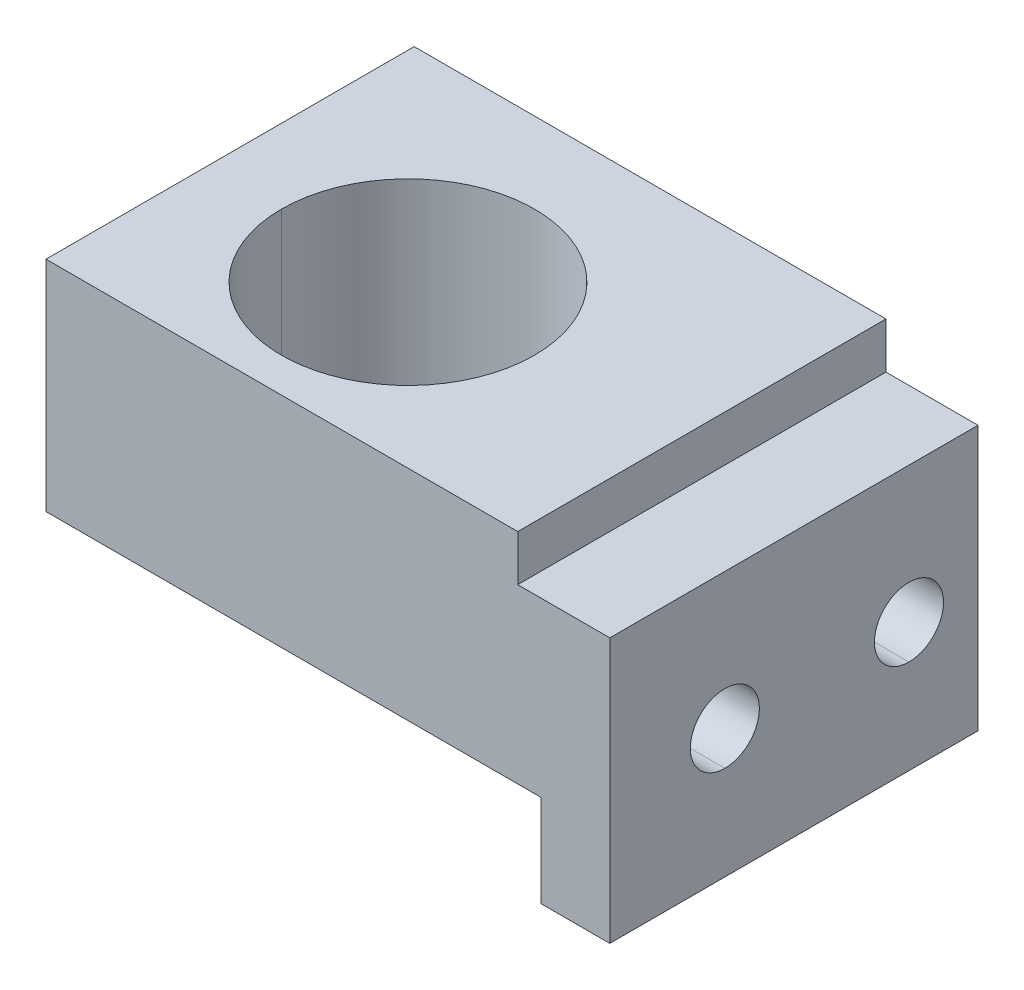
ISO-10303-21;
HEADER;
FILE_DESCRIPTION(('STEP AP214'),'2;1');
FILE_NAME('part.step','',(''),(''),'','','');
FILE_SCHEMA(('AUTOMOTIVE_DESIGN { 1 0 10303 214 1 1 1 1 }'));
ENDSEC;
DATA;
#1=APPLICATION_CONTEXT('core data for automotive mechanical design processes');
#2=APPLICATION_PROTOCOL_DEFINITION('international standard','automotive_design',2000,#1);
#3=PRODUCT_CONTEXT('',#1,'mechanical');
#4=PRODUCT('Part','Part','',(#3));
#5=PRODUCT_RELATED_PRODUCT_CATEGORY('part','',(#4));
#6=PRODUCT_DEFINITION_FORMATION('','',#4);
#7=PRODUCT_DEFINITION_CONTEXT('part definition',#1,'design');
#8=PRODUCT_DEFINITION('design','',#6,#7);
#9=PRODUCT_DEFINITION_SHAPE('','',#8);
#10=(LENGTH_UNIT() NAMED_UNIT(*) SI_UNIT(.MILLI.,.METRE.));
#11=(NAMED_UNIT(*) PLANE_ANGLE_UNIT() SI_UNIT($,.RADIAN.));
#12=(NAMED_UNIT(*) SI_UNIT($,.STERADIAN.) SOLID_ANGLE_UNIT());
#13=UNCERTAINTY_MEASURE_WITH_UNIT(LENGTH_MEASURE(1.E-05),#10,'distance_accuracy_value','');
#14=(GEOMETRIC_REPRESENTATION_CONTEXT(3) GLOBAL_UNCERTAINTY_ASSIGNED_CONTEXT((#13)) GLOBAL_UNIT_ASSIGNED_CONTEXT((#10,
#11,#12)) REPRESENTATION_CONTEXT('',''));
#15=CARTESIAN_POINT('',(0.,0.,0.));
#16=DIRECTION('',(0.,0.,1.));
#17=DIRECTION('',(1.,0.,0.));
#18=AXIS2_PLACEMENT_3D('',#15,#16,#17);
#19=CARTESIAN_POINT('',(29.36875,-3.68299999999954,-15.875));
#20=DIRECTION('',(1.,0.,0.));
#21=DIRECTION('',(0.,0.,-1.));
#22=AXIS2_PLACEMENT_3D('',#19,#20,#21);
#23=PLANE('',#22);
#24=CARTESIAN_POINT('',(29.36875,-3.68299999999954,-15.875));
#25=DIRECTION('',(1.,0.,0.));
#26=DIRECTION('',(0.,0.,-1.));
#27=AXIS2_PLACEMENT_3D('',#24,#25,#26);
#28=CIRCLE('',#27,4.7625);
#29=CARTESIAN_POINT('',(29.36875,1.07950000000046,-15.875));
#30=VERTEX_POINT('',#29);
#31=CARTESIAN_POINT('',(29.36875,-8.44549999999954,-15.875));
#32=VERTEX_POINT('',#31);
#33=EDGE_CURVE('E19',#30,#32,#28,.F.);
#34=ORIENTED_EDGE('',*,*,#33,.F.);
#35=CARTESIAN_POINT('',(29.36875,-3.68299999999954,-15.875));
#36=DIRECTION('',(1.,0.,0.));
#37=DIRECTION('',(0.,0.,-1.));
#38=AXIS2_PLACEMENT_3D('',#35,#36,#37);
#39=CIRCLE('',#38,4.7625);
#40=EDGE_CURVE('E83',#32,#30,#39,.F.);
#41=ORIENTED_EDGE('',*,*,#40,.F.);
#42=EDGE_LOOP('',(#34,#41));
#43=FACE_BOUND('',#42,.T.);
#44=ADVANCED_FACE('F16',(#43),#23,.T.);
#45=CARTESIAN_POINT('',(29.36875,-3.68299999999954,9.525));
#46=DIRECTION('',(1.,0.,0.));
#47=DIRECTION('',(0.,0.,-1.));
#48=AXIS2_PLACEMENT_3D('',#45,#46,#47);
#49=PLANE('',#48);
#50=CARTESIAN_POINT('',(29.36875,-3.68299999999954,9.525));
#51=DIRECTION('',(1.,0.,0.));
#52=DIRECTION('',(0.,0.,-1.));
#53=AXIS2_PLACEMENT_3D('',#50,#51,#52);
#54=CIRCLE('',#53,4.7625);
#55=CARTESIAN_POINT('',(29.36875,1.07950000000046,9.525));
#56=VERTEX_POINT('',#55);
#57=CARTESIAN_POINT('',(29.36875,-8.44549999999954,9.525));
#58=VERTEX_POINT('',#57);
#59=EDGE_CURVE('E87',#56,#58,#54,.F.);
#60=ORIENTED_EDGE('',*,*,#59,.F.);
#61=CARTESIAN_POINT('',(29.36875,-3.68299999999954,9.525));
#62=DIRECTION('',(1.,0.,0.));
#63=DIRECTION('',(0.,0.,-1.));
#64=AXIS2_PLACEMENT_3D('',#61,#62,#63);
#65=CIRCLE('',#64,4.7625);
#66=EDGE_CURVE('E91',#58,#56,#65,.F.);
#67=ORIENTED_EDGE('',*,*,#66,.F.);
#68=EDGE_LOOP('',(#60,#67));
#69=FACE_BOUND('',#68,.T.);
#70=ADVANCED_FACE('F372',(#69),#49,.T.);
#71=CARTESIAN_POINT('',(29.36875,-3.68299999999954,-15.875));
#72=DIRECTION('',(1.,0.,0.));
#73=DIRECTION('',(0.,0.,-1.));
#74=AXIS2_PLACEMENT_3D('',#71,#72,#73);
#75=CYLINDRICAL_SURFACE('',#74,4.7625);
#76=DIRECTION('',(1.,0.,0.));
#77=VECTOR('',#76,1.);
#78=CARTESIAN_POINT('',(38.89375,-8.44549999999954,-15.875));
#79=LINE('',#78,#77);
#80=CARTESIAN_POINT('',(38.89375,-8.44549999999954,-15.875));
#81=VERTEX_POINT('',#80);
#82=EDGE_CURVE('E78',#81,#32,#79,.F.);
#83=ORIENTED_EDGE('',*,*,#82,.F.);
#84=CARTESIAN_POINT('',(38.89375,-3.68299999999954,-15.875));
#85=DIRECTION('',(1.,0.,0.));
#86=DIRECTION('',(0.,0.,-1.));
#87=AXIS2_PLACEMENT_3D('',#84,#85,#86);
#88=CIRCLE('',#87,4.7625);
#89=CARTESIAN_POINT('',(38.89375,1.07950000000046,-15.875));
#90=VERTEX_POINT('',#89);
#91=EDGE_CURVE('E94',#81,#90,#88,.T.);
#92=ORIENTED_EDGE('',*,*,#91,.T.);
#93=DIRECTION('',(1.,0.,0.));
#94=VECTOR('',#93,1.);
#95=CARTESIAN_POINT('',(38.89375,1.07950000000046,-15.875));
#96=LINE('',#95,#94);
#97=EDGE_CURVE('E80',#30,#90,#96,.T.);
#98=ORIENTED_EDGE('',*,*,#97,.F.);
#99=ORIENTED_EDGE('',*,*,#33,.T.);
#100=EDGE_LOOP('',(#83,#92,#98,#99));
#101=FACE_BOUND('',#100,.T.);
#102=ADVANCED_FACE('F76',(#101),#75,.F.);
#103=CARTESIAN_POINT('',(29.36875,-3.68299999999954,-15.875));
#104=DIRECTION('',(1.,0.,0.));
#105=DIRECTION('',(0.,0.,-1.));
#106=AXIS2_PLACEMENT_3D('',#103,#104,#105);
#107=CYLINDRICAL_SURFACE('',#106,4.7625);
#108=ORIENTED_EDGE('',*,*,#82,.T.);
#109=ORIENTED_EDGE('',*,*,#40,.T.);
#110=ORIENTED_EDGE('',*,*,#97,.T.);
#111=CARTESIAN_POINT('',(38.89375,-3.68299999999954,-15.875));
#112=DIRECTION('',(1.,0.,0.));
#113=DIRECTION('',(0.,0.,-1.));
#114=AXIS2_PLACEMENT_3D('',#111,#112,#113);
#115=CIRCLE('',#114,4.7625);
#116=EDGE_CURVE('E85',#90,#81,#115,.T.);
#117=ORIENTED_EDGE('',*,*,#116,.T.);
#118=EDGE_LOOP('',(#108,#109,#110,#117));
#119=FACE_BOUND('',#118,.T.);
#120=ADVANCED_FACE('F82',(#119),#107,.F.);
#121=CARTESIAN_POINT('',(29.36875,-3.68299999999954,9.525));
#122=DIRECTION('',(1.,0.,0.));
#123=DIRECTION('',(0.,0.,-1.));
#124=AXIS2_PLACEMENT_3D('',#121,#122,#123);
#125=CYLINDRICAL_SURFACE('',#124,4.7625);
#126=DIRECTION('',(1.,0.,0.));
#127=VECTOR('',#126,1.);
#128=CARTESIAN_POINT('',(38.89375,-8.44549999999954,9.525));
#129=LINE('',#128,#127);
#130=CARTESIAN_POINT('',(38.89375,-8.44549999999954,9.525));
#131=VERTEX_POINT('',#130);
#132=EDGE_CURVE('E95',#131,#58,#129,.F.);
#133=ORIENTED_EDGE('',*,*,#132,.F.);
#134=CARTESIAN_POINT('',(38.89375,-3.68299999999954,9.525));
#135=DIRECTION('',(1.,0.,0.));
#136=DIRECTION('',(0.,0.,-1.));
#137=AXIS2_PLACEMENT_3D('',#134,#135,#136);
#138=CIRCLE('',#137,4.7625);
#139=CARTESIAN_POINT('',(38.89375,1.07950000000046,9.525));
#140=VERTEX_POINT('',#139);
#141=EDGE_CURVE('E98',#131,#140,#138,.T.);
#142=ORIENTED_EDGE('',*,*,#141,.T.);
#143=DIRECTION('',(1.,0.,0.));
#144=VECTOR('',#143,1.);
#145=CARTESIAN_POINT('',(38.89375,1.07950000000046,9.525));
#146=LINE('',#145,#144);
#147=EDGE_CURVE('E88',#56,#140,#146,.T.);
#148=ORIENTED_EDGE('',*,*,#147,.F.);
#149=ORIENTED_EDGE('',*,*,#59,.T.);
#150=EDGE_LOOP('',(#133,#142,#148,#149));
#151=FACE_BOUND('',#150,.T.);
#152=ADVANCED_FACE('F351',(#151),#125,.F.);
#153=CARTESIAN_POINT('',(29.36875,-3.68299999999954,9.525));
#154=DIRECTION('',(1.,0.,0.));
#155=DIRECTION('',(0.,0.,-1.));
#156=AXIS2_PLACEMENT_3D('',#153,#154,#155);
#157=CYLINDRICAL_SURFACE('',#156,4.7625);
#158=ORIENTED_EDGE('',*,*,#132,.T.);
#159=ORIENTED_EDGE('',*,*,#66,.T.);
#160=ORIENTED_EDGE('',*,*,#147,.T.);
#161=CARTESIAN_POINT('',(38.89375,-3.68299999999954,9.525));
#162=DIRECTION('',(1.,0.,0.));
#163=DIRECTION('',(0.,0.,-1.));
#164=AXIS2_PLACEMENT_3D('',#161,#162,#163);
#165=CIRCLE('',#164,4.7625);
#166=EDGE_CURVE('E101',#140,#131,#165,.T.);
#167=ORIENTED_EDGE('',*,*,#166,.T.);
#168=EDGE_LOOP('',(#158,#159,#160,#167));
#169=FACE_BOUND('',#168,.T.);
#170=ADVANCED_FACE('F344',(#169),#157,.F.);
#171=CARTESIAN_POINT('',(38.89375,21.1772500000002,0.));
#172=DIRECTION('',(-1.,0.,0.));
#173=DIRECTION('',(0.,0.,1.));
#174=AXIS2_PLACEMENT_3D('',#171,#172,#173);
#175=PLANE('',#174);
#176=DIRECTION('',(0.,1.,0.));
#177=VECTOR('',#176,1.);
#178=CARTESIAN_POINT('',(38.89375,21.1772500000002,25.4));
#179=LINE('',#178,#177);
#180=CARTESIAN_POINT('',(38.89375,15.08125,25.4));
#181=VERTEX_POINT('',#180);
#182=CARTESIAN_POINT('',(38.89375,-21.43125,25.4));
#183=VERTEX_POINT('',#182);
#184=EDGE_CURVE('E151',#181,#183,#179,.F.);
#185=ORIENTED_EDGE('',*,*,#184,.T.);
#186=DIRECTION('',(0.,0.,1.));
#187=VECTOR('',#186,1.);
#188=CARTESIAN_POINT('',(38.89375,-21.43125,0.));
#189=LINE('',#188,#187);
#190=CARTESIAN_POINT('',(38.89375,-21.43125,-25.4));
#191=VERTEX_POINT('',#190);
#192=EDGE_CURVE('E124',#183,#191,#189,.F.);
#193=ORIENTED_EDGE('',*,*,#192,.T.);
#194=DIRECTION('',(0.,1.,0.));
#195=VECTOR('',#194,1.);
#196=CARTESIAN_POINT('',(38.89375,21.1772500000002,-25.4));
#197=LINE('',#196,#195);
#198=CARTESIAN_POINT('',(38.89375,15.08125,-25.4));
#199=VERTEX_POINT('',#198);
#200=EDGE_CURVE('E139',#191,#199,#197,.T.);
#201=ORIENTED_EDGE('',*,*,#200,.T.);
#202=DIRECTION('',(0.,0.,1.));
#203=VECTOR('',#202,1.);
#204=CARTESIAN_POINT('',(38.89375,15.08125,0.));
#205=LINE('',#204,#203);
#206=EDGE_CURVE('E104',#181,#199,#205,.F.);
#207=ORIENTED_EDGE('',*,*,#206,.F.);
#208=EDGE_LOOP('',(#185,#193,#201,#207));
#209=FACE_BOUND('',#208,.T.);
#210=ORIENTED_EDGE('',*,*,#141,.F.);
#211=ORIENTED_EDGE('',*,*,#166,.F.);
#212=EDGE_LOOP('',(#210,#211));
#213=FACE_BOUND('',#212,.T.);
#214=ORIENTED_EDGE('',*,*,#91,.F.);
#215=ORIENTED_EDGE('',*,*,#116,.F.);
#216=EDGE_LOOP('',(#214,#215));
#217=FACE_BOUND('',#216,.T.);
#218=ADVANCED_FACE('F255',(#209,#213,#217),#175,.F.);
#219=CARTESIAN_POINT('',(26.19375,18.25625,0.));
#220=DIRECTION('',(1.,0.,0.));
#221=DIRECTION('',(0.,0.,-1.));
#222=AXIS2_PLACEMENT_3D('',#219,#220,#221);
#223=PLANE('',#222);
#224=DIRECTION('',(0.,0.,1.));
#225=VECTOR('',#224,1.);
#226=CARTESIAN_POINT('',(26.19375,21.43125,0.));
#227=LINE('',#226,#225);
#228=CARTESIAN_POINT('',(26.19375,21.43125,25.4));
#229=VERTEX_POINT('',#228);
#230=CARTESIAN_POINT('',(26.19375,21.43125,-25.4));
#231=VERTEX_POINT('',#230);
#232=EDGE_CURVE('E127',#229,#231,#227,.F.);
#233=ORIENTED_EDGE('',*,*,#232,.F.);
#234=DIRECTION('',(0.,1.,0.));
#235=VECTOR('',#234,1.);
#236=CARTESIAN_POINT('',(26.19375,21.1772500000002,25.4));
#237=LINE('',#236,#235);
#238=CARTESIAN_POINT('',(26.19375,15.08125,25.4));
#239=VERTEX_POINT('',#238);
#240=EDGE_CURVE('E163',#229,#239,#237,.F.);
#241=ORIENTED_EDGE('',*,*,#240,.T.);
#242=DIRECTION('',(0.,0.,1.));
#243=VECTOR('',#242,1.);
#244=CARTESIAN_POINT('',(26.19375,15.08125,0.));
#245=LINE('',#244,#243);
#246=CARTESIAN_POINT('',(26.19375,15.08125,-25.4));
#247=VERTEX_POINT('',#246);
#248=EDGE_CURVE('E121',#247,#239,#245,.T.);
#249=ORIENTED_EDGE('',*,*,#248,.F.);
#250=DIRECTION('',(0.,1.,0.));
#251=VECTOR('',#250,1.);
#252=CARTESIAN_POINT('',(26.19375,21.1772500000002,-25.4));
#253=LINE('',#252,#251);
#254=EDGE_CURVE('E130',#247,#231,#253,.T.);
#255=ORIENTED_EDGE('',*,*,#254,.T.);
#256=EDGE_LOOP('',(#233,#241,#249,#255));
#257=FACE_BOUND('',#256,.T.);
#258=ADVANCED_FACE('F248',(#257),#223,.T.);
#259=CARTESIAN_POINT('',(32.54375,15.08125,0.));
#260=DIRECTION('',(0.,1.,0.));
#261=DIRECTION('',(0.,0.,1.));
#262=AXIS2_PLACEMENT_3D('',#259,#260,#261);
#263=PLANE('',#262);
#264=ORIENTED_EDGE('',*,*,#248,.T.);
#265=DIRECTION('',(-1.,0.,0.));
#266=VECTOR('',#265,1.);
#267=CARTESIAN_POINT('',(0.,15.08125,25.4));
#268=LINE('',#267,#266);
#269=EDGE_CURVE('E166',#239,#181,#268,.F.);
#270=ORIENTED_EDGE('',*,*,#269,.T.);
#271=ORIENTED_EDGE('',*,*,#206,.T.);
#272=DIRECTION('',(1.,0.,0.));
#273=VECTOR('',#272,1.);
#274=CARTESIAN_POINT('',(0.,15.08125,-25.4));
#275=LINE('',#274,#273);
#276=EDGE_CURVE('E142',#199,#247,#275,.F.);
#277=ORIENTED_EDGE('',*,*,#276,.T.);
#278=EDGE_LOOP('',(#264,#270,#271,#277));
#279=FACE_BOUND('',#278,.T.);
#280=ADVANCED_FACE('F251',(#279),#263,.T.);
#281=CARTESIAN_POINT('',(34.925,-21.43125,0.));
#282=DIRECTION('',(0.,1.,0.));
#283=DIRECTION('',(0.,0.,1.));
#284=AXIS2_PLACEMENT_3D('',#281,#282,#283);
#285=PLANE('',#284);
#286=DIRECTION('',(-1.,0.,0.));
#287=VECTOR('',#286,1.);
#288=CARTESIAN_POINT('',(0.,-21.43125,25.4));
#289=LINE('',#288,#287);
#290=CARTESIAN_POINT('',(29.36875,-21.43125,25.4));
#291=VERTEX_POINT('',#290);
#292=EDGE_CURVE('E154',#183,#291,#289,.T.);
#293=ORIENTED_EDGE('',*,*,#292,.T.);
#294=DIRECTION('',(0.,0.,-1.));
#295=VECTOR('',#294,1.);
#296=CARTESIAN_POINT('',(29.36875,-21.43125,0.));
#297=LINE('',#296,#295);
#298=CARTESIAN_POINT('',(29.36875,-21.43125,-25.4));
#299=VERTEX_POINT('',#298);
#300=EDGE_CURVE('E107',#291,#299,#297,.T.);
#301=ORIENTED_EDGE('',*,*,#300,.T.);
#302=DIRECTION('',(1.,0.,0.));
#303=VECTOR('',#302,1.);
#304=CARTESIAN_POINT('',(0.,-21.43125,-25.4));
#305=LINE('',#304,#303);
#306=EDGE_CURVE('E136',#299,#191,#305,.T.);
#307=ORIENTED_EDGE('',*,*,#306,.T.);
#308=ORIENTED_EDGE('',*,*,#192,.F.);
#309=EDGE_LOOP('',(#293,#301,#307,#308));
#310=FACE_BOUND('',#309,.T.);
#311=ADVANCED_FACE('F258',(#310),#285,.F.);
#312=CARTESIAN_POINT('',(0.,21.43125,0.));
#313=DIRECTION('',(0.,1.,0.));
#314=DIRECTION('',(0.,0.,1.));
#315=AXIS2_PLACEMENT_3D('',#312,#313,#314);
#316=PLANE('',#315);
#317=CARTESIAN_POINT('',(-11.1767298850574,21.43125,3.175));
#318=DIRECTION('',(0.,-1.,0.));
#319=DIRECTION('',(0.,0.,-1.));
#320=AXIS2_PLACEMENT_3D('',#317,#318,#319);
#321=CIRCLE('',#320,17.4625);
#322=CARTESIAN_POINT('',(6.28577011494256,21.43125,3.175));
#323=VERTEX_POINT('',#322);
#324=CARTESIAN_POINT('',(-28.6392298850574,21.43125,3.175));
#325=VERTEX_POINT('',#324);
#326=EDGE_CURVE('E105',#323,#325,#321,.T.);
#327=ORIENTED_EDGE('',*,*,#326,.T.);
#328=CARTESIAN_POINT('',(-11.1767298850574,21.43125,3.175));
#329=DIRECTION('',(0.,-1.,0.));
#330=DIRECTION('',(0.,0.,-1.));
#331=AXIS2_PLACEMENT_3D('',#328,#329,#330);
#332=CIRCLE('',#331,17.4625);
#333=EDGE_CURVE('E108',#325,#323,#332,.T.);
#334=ORIENTED_EDGE('',*,*,#333,.T.);
#335=EDGE_LOOP('',(#327,#334));
#336=FACE_BOUND('',#335,.T.);
#337=DIRECTION('',(0.,0.,-1.));
#338=VECTOR('',#337,1.);
#339=CARTESIAN_POINT('',(-38.89375,21.43125,0.));
#340=LINE('',#339,#338);
#341=CARTESIAN_POINT('',(-38.89375,21.43125,-25.4));
#342=VERTEX_POINT('',#341);
#343=CARTESIAN_POINT('',(-38.89375,21.43125,25.4));
#344=VERTEX_POINT('',#343);
#345=EDGE_CURVE('E148',#342,#344,#340,.F.);
#346=ORIENTED_EDGE('',*,*,#345,.T.);
#347=DIRECTION('',(-1.,0.,0.));
#348=VECTOR('',#347,1.);
#349=CARTESIAN_POINT('',(0.,21.43125,25.4));
#350=LINE('',#349,#348);
#351=EDGE_CURVE('E160',#344,#229,#350,.F.);
#352=ORIENTED_EDGE('',*,*,#351,.T.);
#353=ORIENTED_EDGE('',*,*,#232,.T.);
#354=DIRECTION('',(1.,0.,0.));
#355=VECTOR('',#354,1.);
#356=CARTESIAN_POINT('',(0.,21.43125,-25.4));
#357=LINE('',#356,#355);
#358=EDGE_CURVE('E133',#231,#342,#357,.F.);
#359=ORIENTED_EDGE('',*,*,#358,.T.);
#360=EDGE_LOOP('',(#346,#352,#353,#359));
#361=FACE_BOUND('',#360,.T.);
#362=ADVANCED_FACE('F241',(#336,#361),#316,.T.);
#363=CARTESIAN_POINT('',(0.,21.1772500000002,-25.4));
#364=DIRECTION('',(0.,0.,1.));
#365=DIRECTION('',(1.,0.,0.));
#366=AXIS2_PLACEMENT_3D('',#363,#364,#365);
#367=PLANE('',#366);
#368=ORIENTED_EDGE('',*,*,#200,.F.);
#369=ORIENTED_EDGE('',*,*,#306,.F.);
#370=DIRECTION('',(0.,1.,0.));
#371=VECTOR('',#370,1.);
#372=CARTESIAN_POINT('',(29.36875,-15.08125,-25.4));
#373=LINE('',#372,#371);
#374=CARTESIAN_POINT('',(29.36875,-8.73124999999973,-25.4));
#375=VERTEX_POINT('',#374);
#376=EDGE_CURVE('E169',#299,#375,#373,.T.);
#377=ORIENTED_EDGE('',*,*,#376,.T.);
#378=DIRECTION('',(1.,0.,0.));
#379=VECTOR('',#378,1.);
#380=CARTESIAN_POINT('',(-30.2267298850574,-8.73124999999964,-25.4));
#381=LINE('',#380,#379);
#382=CARTESIAN_POINT('',(-38.89375,-8.73124999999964,-25.4));
#383=VERTEX_POINT('',#382);
#384=EDGE_CURVE('E180',#375,#383,#381,.F.);
#385=ORIENTED_EDGE('',*,*,#384,.T.);
#386=DIRECTION('',(0.,1.,0.));
#387=VECTOR('',#386,1.);
#388=CARTESIAN_POINT('',(-38.89375,21.1772500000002,-25.4));
#389=LINE('',#388,#387);
#390=EDGE_CURVE('E145',#383,#342,#389,.T.);
#391=ORIENTED_EDGE('',*,*,#390,.T.);
#392=ORIENTED_EDGE('',*,*,#358,.F.);
#393=ORIENTED_EDGE('',*,*,#254,.F.);
#394=ORIENTED_EDGE('',*,*,#276,.F.);
#395=EDGE_LOOP('',(#368,#369,#377,#385,#391,#392,#393,#394));
#396=FACE_BOUND('',#395,.T.);
#397=ADVANCED_FACE('F245',(#396),#367,.F.);
#398=CARTESIAN_POINT('',(-38.89375,21.1772500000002,0.));
#399=DIRECTION('',(1.,0.,0.));
#400=DIRECTION('',(0.,0.,-1.));
#401=AXIS2_PLACEMENT_3D('',#398,#399,#400);
#402=PLANE('',#401);
#403=ORIENTED_EDGE('',*,*,#345,.F.);
#404=ORIENTED_EDGE('',*,*,#390,.F.);
#405=DIRECTION('',(0.,0.,1.));
#406=VECTOR('',#405,1.);
#407=CARTESIAN_POINT('',(-38.89375,-8.73124999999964,-19.84375));
#408=LINE('',#407,#406);
#409=CARTESIAN_POINT('',(-38.89375,-8.73124999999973,25.4));
#410=VERTEX_POINT('',#409);
#411=EDGE_CURVE('E183',#383,#410,#408,.T.);
#412=ORIENTED_EDGE('',*,*,#411,.T.);
#413=DIRECTION('',(0.,1.,0.));
#414=VECTOR('',#413,1.);
#415=CARTESIAN_POINT('',(-38.89375,21.1772500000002,25.4));
#416=LINE('',#415,#414);
#417=EDGE_CURVE('E157',#410,#344,#416,.T.);
#418=ORIENTED_EDGE('',*,*,#417,.T.);
#419=EDGE_LOOP('',(#403,#404,#412,#418));
#420=FACE_BOUND('',#419,.T.);
#421=ADVANCED_FACE('F216',(#420),#402,.F.);
#422=CARTESIAN_POINT('',(0.,21.1772500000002,25.4));
#423=DIRECTION('',(0.,0.,-1.));
#424=DIRECTION('',(-1.,0.,0.));
#425=AXIS2_PLACEMENT_3D('',#422,#423,#424);
#426=PLANE('',#425);
#427=ORIENTED_EDGE('',*,*,#240,.F.);
#428=ORIENTED_EDGE('',*,*,#351,.F.);
#429=ORIENTED_EDGE('',*,*,#417,.F.);
#430=DIRECTION('',(1.,0.,0.));
#431=VECTOR('',#430,1.);
#432=CARTESIAN_POINT('',(-30.2267298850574,-8.73124999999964,25.4));
#433=LINE('',#432,#431);
#434=CARTESIAN_POINT('',(29.36875,-8.73124999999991,25.4));
#435=VERTEX_POINT('',#434);
#436=EDGE_CURVE('E186',#410,#435,#433,.T.);
#437=ORIENTED_EDGE('',*,*,#436,.T.);
#438=DIRECTION('',(0.,1.,0.));
#439=VECTOR('',#438,1.);
#440=CARTESIAN_POINT('',(29.36875,-15.08125,25.4));
#441=LINE('',#440,#439);
#442=EDGE_CURVE('E172',#435,#291,#441,.F.);
#443=ORIENTED_EDGE('',*,*,#442,.T.);
#444=ORIENTED_EDGE('',*,*,#292,.F.);
#445=ORIENTED_EDGE('',*,*,#184,.F.);
#446=ORIENTED_EDGE('',*,*,#269,.F.);
#447=EDGE_LOOP('',(#427,#428,#429,#437,#443,#444,#445,#446));
#448=FACE_BOUND('',#447,.T.);
#449=ADVANCED_FACE('F209',(#448),#426,.F.);
#450=CARTESIAN_POINT('',(29.36875,-15.08125,0.));
#451=DIRECTION('',(1.,0.,0.));
#452=DIRECTION('',(0.,0.,-1.));
#453=AXIS2_PLACEMENT_3D('',#450,#451,#452);
#454=PLANE('',#453);
#455=ORIENTED_EDGE('',*,*,#442,.F.);
#456=DIRECTION('',(0.,0.,1.));
#457=VECTOR('',#456,1.);
#458=CARTESIAN_POINT('',(29.36875,-8.73124999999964,-19.84375));
#459=LINE('',#458,#457);
#460=EDGE_CURVE('E113',#435,#375,#459,.F.);
#461=ORIENTED_EDGE('',*,*,#460,.T.);
#462=ORIENTED_EDGE('',*,*,#376,.F.);
#463=ORIENTED_EDGE('',*,*,#300,.F.);
#464=EDGE_LOOP('',(#455,#461,#462,#463));
#465=FACE_BOUND('',#464,.T.);
#466=ADVANCED_FACE('F194',(#465),#454,.F.);
#467=CARTESIAN_POINT('',(-11.1767298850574,5.55625000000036,3.175));
#468=DIRECTION('',(0.,-1.,0.));
#469=DIRECTION('',(0.,0.,-1.));
#470=AXIS2_PLACEMENT_3D('',#467,#468,#469);
#471=CYLINDRICAL_SURFACE('',#470,17.4625);
#472=CARTESIAN_POINT('',(-11.1767298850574,-8.73124999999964,3.175));
#473=DIRECTION('',(0.,-1.,0.));
#474=DIRECTION('',(0.,0.,-1.));
#475=AXIS2_PLACEMENT_3D('',#472,#473,#474);
#476=CIRCLE('',#475,17.4625);
#477=CARTESIAN_POINT('',(6.28577011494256,-8.73124999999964,3.175));
#478=VERTEX_POINT('',#477);
#479=CARTESIAN_POINT('',(-28.6392298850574,-8.73124999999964,3.175));
#480=VERTEX_POINT('',#479);
#481=EDGE_CURVE('E25',#478,#480,#476,.T.);
#482=ORIENTED_EDGE('',*,*,#481,.T.);
#483=DIRECTION('',(0.,-1.,0.));
#484=VECTOR('',#483,1.);
#485=CARTESIAN_POINT('',(-28.6392298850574,5.55625000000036,3.175));
#486=LINE('',#485,#484);
#487=EDGE_CURVE('E33',#480,#325,#486,.F.);
#488=ORIENTED_EDGE('',*,*,#487,.T.);
#489=ORIENTED_EDGE('',*,*,#326,.F.);
#490=DIRECTION('',(0.,-1.,0.));
#491=VECTOR('',#490,1.);
#492=CARTESIAN_POINT('',(6.28577011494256,5.55625000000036,3.175));
#493=LINE('',#492,#491);
#494=EDGE_CURVE('E111',#323,#478,#493,.T.);
#495=ORIENTED_EDGE('',*,*,#494,.T.);
#496=EDGE_LOOP('',(#482,#488,#489,#495));
#497=FACE_BOUND('',#496,.T.);
#498=ADVANCED_FACE('F279',(#497),#471,.F.);
#499=CARTESIAN_POINT('',(-11.1767298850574,5.55625000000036,3.175));
#500=DIRECTION('',(0.,-1.,0.));
#501=DIRECTION('',(0.,0.,-1.));
#502=AXIS2_PLACEMENT_3D('',#499,#500,#501);
#503=CYLINDRICAL_SURFACE('',#502,17.4625);
#504=ORIENTED_EDGE('',*,*,#333,.F.);
#505=ORIENTED_EDGE('',*,*,#487,.F.);
#506=CARTESIAN_POINT('',(-11.1767298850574,-8.73124999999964,3.175));
#507=DIRECTION('',(0.,-1.,0.));
#508=DIRECTION('',(0.,0.,-1.));
#509=AXIS2_PLACEMENT_3D('',#506,#507,#508);
#510=CIRCLE('',#509,17.4625);
#511=EDGE_CURVE('E11',#480,#478,#510,.T.);
#512=ORIENTED_EDGE('',*,*,#511,.T.);
#513=ORIENTED_EDGE('',*,*,#494,.F.);
#514=EDGE_LOOP('',(#504,#505,#512,#513));
#515=FACE_BOUND('',#514,.T.);
#516=ADVANCED_FACE('F273',(#515),#503,.F.);
#517=CARTESIAN_POINT('',(-30.2267298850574,-8.73124999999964,-19.84375));
#518=DIRECTION('',(0.,1.,0.));
#519=DIRECTION('',(0.,0.,1.));
#520=AXIS2_PLACEMENT_3D('',#517,#518,#519);
#521=PLANE('',#520);
#522=ORIENTED_EDGE('',*,*,#481,.F.);
#523=ORIENTED_EDGE('',*,*,#511,.F.);
#524=EDGE_LOOP('',(#522,#523));
#525=FACE_BOUND('',#524,.T.);
#526=ORIENTED_EDGE('',*,*,#436,.F.);
#527=ORIENTED_EDGE('',*,*,#411,.F.);
#528=ORIENTED_EDGE('',*,*,#384,.F.);
#529=ORIENTED_EDGE('',*,*,#460,.F.);
#530=EDGE_LOOP('',(#526,#527,#528,#529));
#531=FACE_BOUND('',#530,.T.);
#532=ADVANCED_FACE('F202',(#525,#531),#521,.F.);
#533=CLOSED_SHELL('',(#44,#70,#102,#120,#152,#170,#218,#258,#280,#311,#362,#397,#421,#449,#466,
#498,#516,#532));
#534=MANIFOLD_SOLID_BREP('B1',#533);
#535=ADVANCED_BREP_SHAPE_REPRESENTATION('',(#18,#534),#14);
#536=SHAPE_DEFINITION_REPRESENTATION(#9,#535);
ENDSEC;
END-ISO-10303-21;
